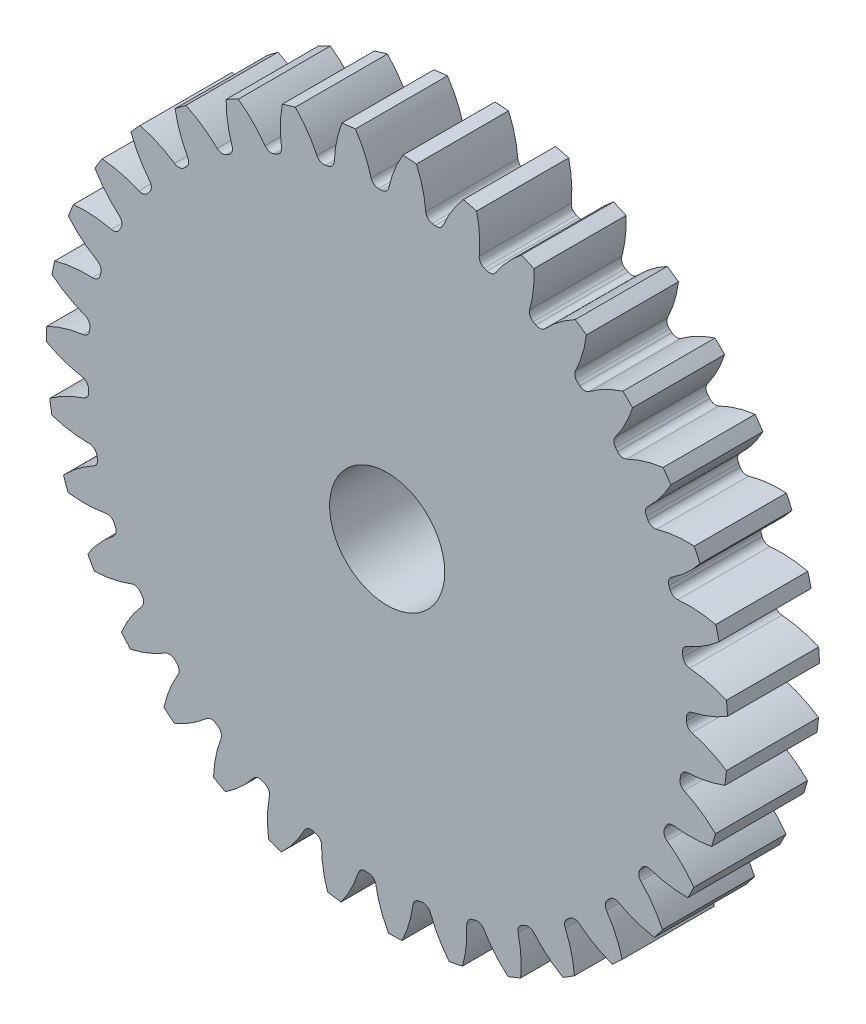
from build123d import *

# Parameters (mm, degrees)
SKETCH3_R         = 375.92
GEARBODY_DEPTH    = 101.6
TOOTHCUT_DEPTH    = 542.25248526
CIRPATTERN1_COUNT = 35
BOREDIA_R         = 63.5
BORE_DEPTH        = 12700


with BuildPart() as part:
    # Sketch3 → gearBody (new body)
    with BuildSketch(Plane.XY):
        Circle(SKETCH3_R)
    extrude(amount=GEARBODY_DEPTH)

    # Sketch2 → toothCut (cut, through all)
    with BuildSketch(Plane.XY):
        with BuildLine():
            ThreePointArc((330.085388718, -8.69920426), (330.125053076, -7.034865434), (330.156325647, -5.370347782))
            ThreePointArc((330.156325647, -5.370347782), (332.015390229, -0.279175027), (336.627557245, 2.567590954))
            ThreePointArc((336.627557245, 2.567590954), (356.935653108, 8.896086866), (375.92, 18.491043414))
            ThreePointArc((375.92, 18.491043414), (376.28907376, -8.018606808), (374.791022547, -34.48846916))
            ThreePointArc((374.791022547, -34.48846916), (356.232655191, -24.093488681), (336.212589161, -16.905611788))
            ThreePointArc((336.212589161, -16.905611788), (331.725881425, -13.864951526), (330.085388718, -8.69920426))
        make_face()
    toothcut = extrude(amount=TOOTHCUT_DEPTH, mode=Mode.SUBTRACT)

    # CirPattern1: toothCut ×35 about axis
    cirpattern1_axis = Axis((0, 0, 0), (0, 0, 1))
    for i in range(1, CIRPATTERN1_COUNT):
        add(toothcut.rotate(cirpattern1_axis, i * 360 / CIRPATTERN1_COUNT), mode=Mode.SUBTRACT)

    # boreDia → bore (cut, symmetric)
    with BuildSketch(Plane.XY):
        Circle(BOREDIA_R)
    extrude(amount=BORE_DEPTH, both=True, mode=Mode.SUBTRACT)


solid = part.part
